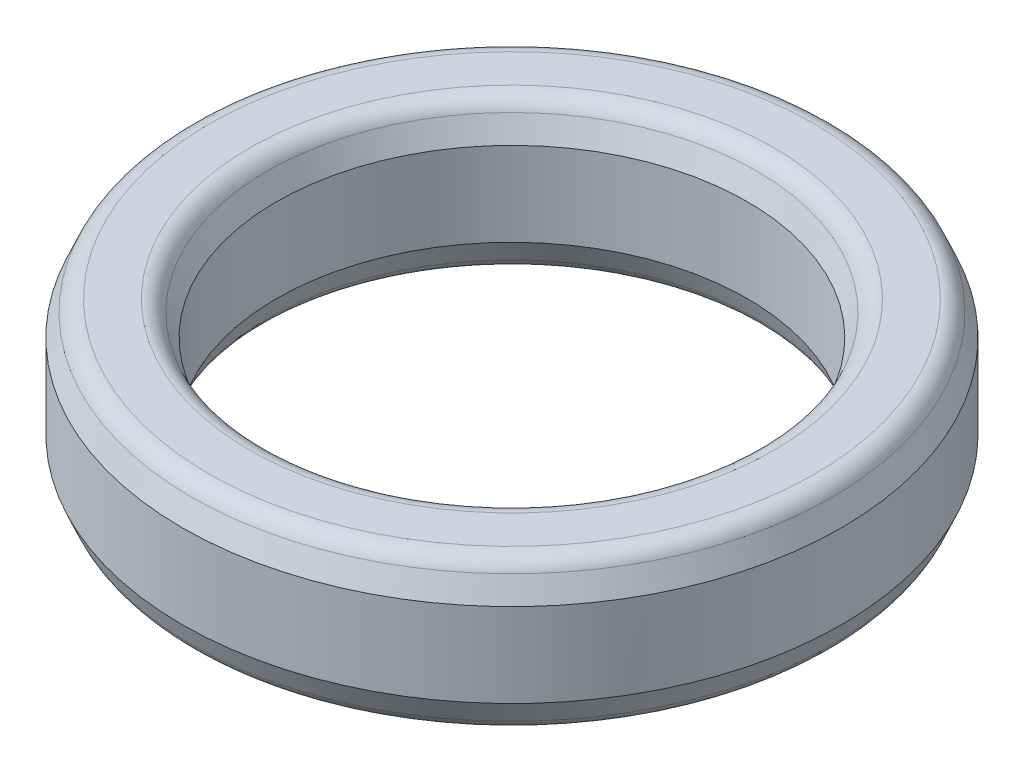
from build123d import *

# Parameters (mm, degrees)
GSK_CORNER_FILLET_R = 1.5875


with BuildPart() as part:
    # Gsk Profile → Gasket Body (revolve)
    with BuildSketch(Plane.XY, mode=Mode.PRIVATE) as gasket_body_sk:
        Polygon((-2.77495, -6.35), (2.77495, -6.35), (3.96875, -3.537583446), (3.96875, 3.537583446), (2.77495, 6.35), (-2.77495, 6.35), (-3.96875, 3.537583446), (-3.96875, -3.537583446), align=None)
    revolve(gasket_body_sk.sketch.rotate(Axis((23.8125, 24.442227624, 0), (0, -1, 0)), 270), axis=Axis((23.8125, 24.442227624, 0), (0, -1, 0)))

    # Gsk Corner Fillet
    gsk_corner_fillet_edges = [part.edges().sort_by_distance(p)[0] for p in [
        (23.8125, 6.35, -26.58745),
        (23.8125, 6.35, -21.03755),
        (23.8125, -6.35, -21.03755),
        (23.8125, -6.35, -26.58745),
    ]]
    fillet(gsk_corner_fillet_edges, radius=GSK_CORNER_FILLET_R)


solid = part.part
